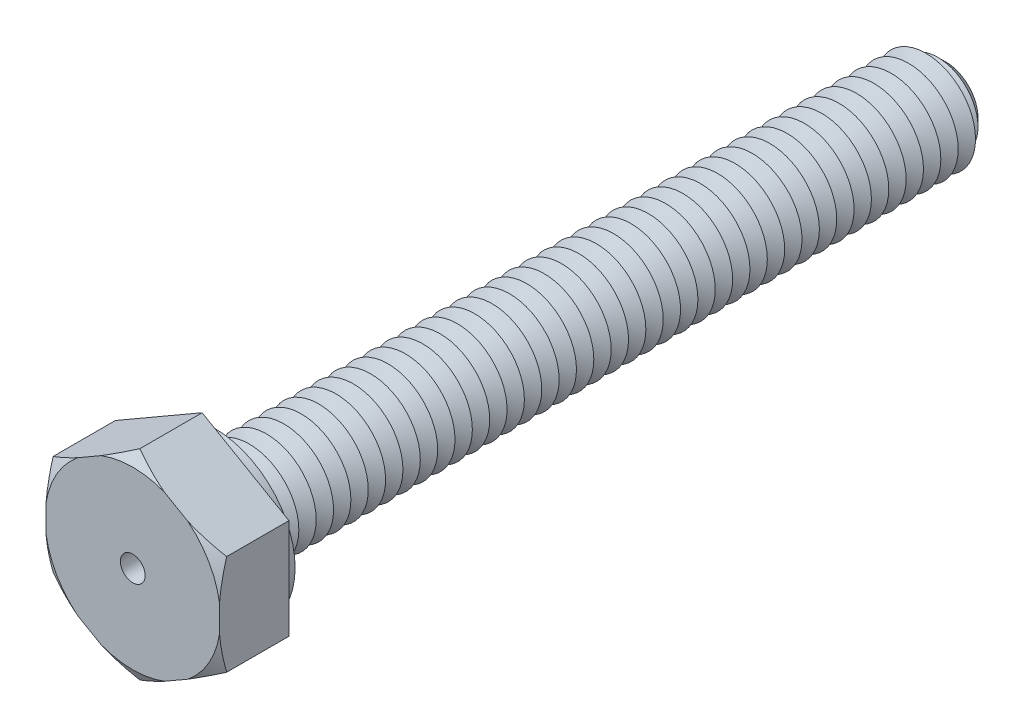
from build123d import *

# Parameters (mm, degrees)
BOSS_EXTRUDE1_DEPTH = 2.8
SKETCH3_R           = 2
BOSS_EXTRUDE2_DEPTH = 30
SKETCH4_R           = 3.25
BOSS_EXTRUDE3_DEPTH = 0.5
CHAMFER1_SIZE       = 0.7
LPATTERN1_COUNT     = 42
LPATTERN1_PITCH     = 0.7
SKETCH8_R           = 0.5
CUT_EXTRUDE1_DEPTH  = 32.8


with BuildPart() as part:
    # Sketch2 → Boss-Extrude1 (new body)
    with BuildSketch(Plane.XY):
        Polygon((0, 4.041451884), (-3.5, 2.020725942), (-3.5, -2.020725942), (0, -4.041451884), (3.5, -2.020725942), (3.5, 2.020725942), align=None)
    extrude(amount=BOSS_EXTRUDE1_DEPTH)

    # Sketch3 → Boss-Extrude2 (add)
    with BuildSketch(Plane(origin=(0, 0, 0), x_dir=(-1, 0, 0), z_dir=(0, 0, -1))):
        Circle(SKETCH3_R)
    extrude(amount=BOSS_EXTRUDE2_DEPTH)

    # Sketch4 → Boss-Extrude3 (add)
    with BuildSketch(Plane(origin=(0, 0, 0), x_dir=(-1, 0, 0), z_dir=(0, 0, -1))):
        with Locations(Location((0, 0, 0), (0, 0, 180))):
            Circle(SKETCH4_R)
    extrude(amount=BOSS_EXTRUDE3_DEPTH)

    # Chamfer1
    chamfer1_edges = [part.edges().sort_by_distance(p)[0] for p in [
        (2, 0, -30),
    ]]
    chamfer(chamfer1_edges, length=CHAMFER1_SIZE)

    # Sketch6 → Cut-Revolve1 (revolve, cut)
    with BuildSketch(Plane(origin=(0, 0, 0), x_dir=(0, 0, -1), z_dir=(1, 0, 0)), mode=Mode.PRIVATE) as cut_revolve1_sk:
        Polygon((0.5, 2), (0.85, 1.393782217), (1.2, 2), align=None)
    cut_revolve1 = revolve(cut_revolve1_sk.sketch.rotate(Axis((0, 0, 3.211670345), (0, 0, -1)), 90), axis=Axis((0, 0, 3.211670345), (0, 0, -1)), mode=Mode.SUBTRACT)

    # LPattern1: Cut-Revolve1 ×42
    with Locations(*[(0, 0, -i * LPATTERN1_PITCH) for i in range(1, LPATTERN1_COUNT)]):
        add(cut_revolve1, mode=Mode.SUBTRACT)

    # Sketch7 → Cut-Revolve2 (revolve, cut)
    with BuildSketch(Plane(origin=(0, 0, 0), x_dir=(0, 0, -1), z_dir=(1, 0, 0)), mode=Mode.PRIVATE) as cut_revolve2_sk:
        Polygon((-2.8, 4.041451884), (-2.8, 3.541451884), (-2.511324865, 4.041451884), align=None)
    revolve(cut_revolve2_sk.sketch.rotate(Axis((0, 0, 3.211670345), (0, 0, -1)), 90), axis=Axis((0, 0, 3.211670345), (0, 0, -1)), mode=Mode.SUBTRACT)

    # Sketch8 → Cut-Extrude1 (cut)
    with BuildSketch(Plane.XY.offset(2.8)):
        Circle(SKETCH8_R)
    extrude(amount=-CUT_EXTRUDE1_DEPTH, mode=Mode.SUBTRACT)


solid = part.part
